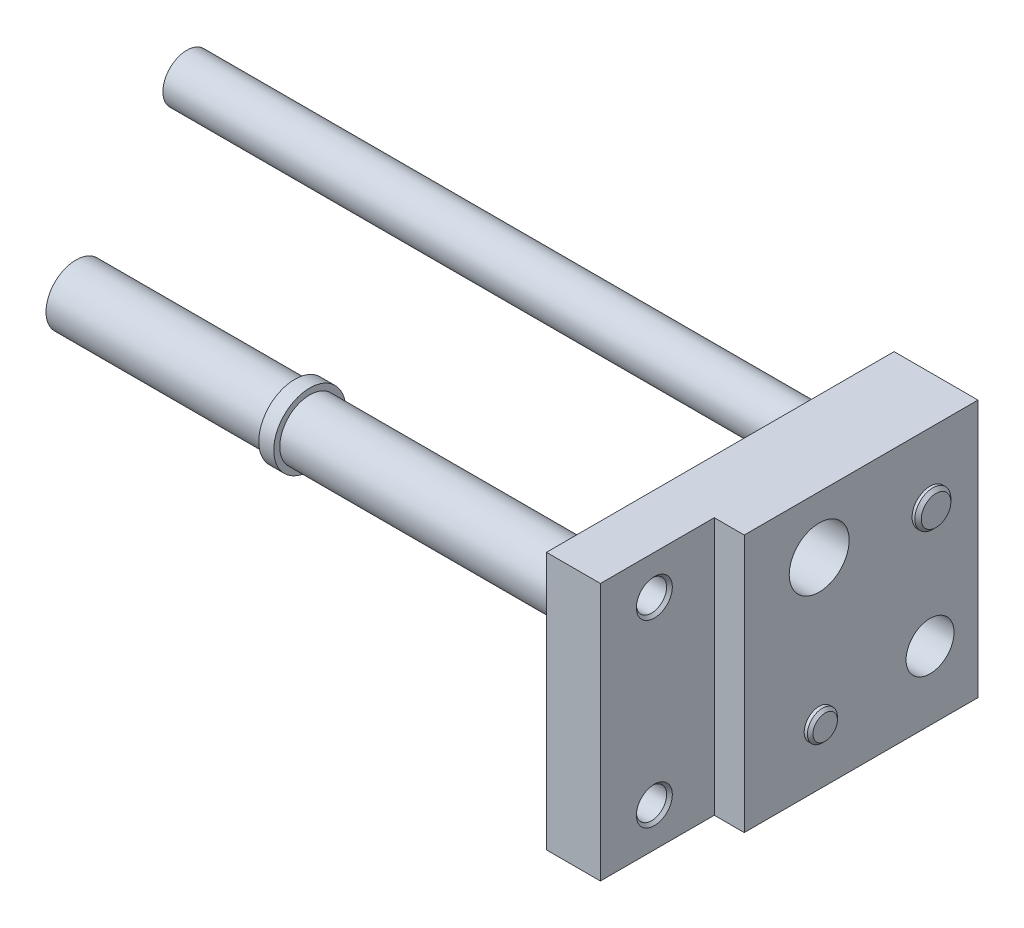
ISO-10303-21;
HEADER;
FILE_DESCRIPTION(('STEP AP214'),'2;1');
FILE_NAME('part.step','',(''),(''),'','','');
FILE_SCHEMA(('AUTOMOTIVE_DESIGN { 1 0 10303 214 1 1 1 1 }'));
ENDSEC;
DATA;
#1=APPLICATION_CONTEXT('core data for automotive mechanical design processes');
#2=APPLICATION_PROTOCOL_DEFINITION('international standard','automotive_design',2000,#1);
#3=PRODUCT_CONTEXT('',#1,'mechanical');
#4=PRODUCT('Part','Part','',(#3));
#5=PRODUCT_RELATED_PRODUCT_CATEGORY('part','',(#4));
#6=PRODUCT_DEFINITION_FORMATION('','',#4);
#7=PRODUCT_DEFINITION_CONTEXT('part definition',#1,'design');
#8=PRODUCT_DEFINITION('design','',#6,#7);
#9=PRODUCT_DEFINITION_SHAPE('','',#8);
#10=(LENGTH_UNIT() NAMED_UNIT(*) SI_UNIT(.MILLI.,.METRE.));
#11=(NAMED_UNIT(*) PLANE_ANGLE_UNIT() SI_UNIT($,.RADIAN.));
#12=(NAMED_UNIT(*) SI_UNIT($,.STERADIAN.) SOLID_ANGLE_UNIT());
#13=UNCERTAINTY_MEASURE_WITH_UNIT(LENGTH_MEASURE(1.E-05),#10,'distance_accuracy_value','');
#14=(GEOMETRIC_REPRESENTATION_CONTEXT(3) GLOBAL_UNCERTAINTY_ASSIGNED_CONTEXT((#13)) GLOBAL_UNIT_ASSIGNED_CONTEXT((#10,
#11,#12)) REPRESENTATION_CONTEXT('',''));
#15=CARTESIAN_POINT('',(0.,0.,0.));
#16=DIRECTION('',(0.,0.,1.));
#17=DIRECTION('',(1.,0.,0.));
#18=AXIS2_PLACEMENT_3D('',#15,#16,#17);
#19=CARTESIAN_POINT('',(0.,-43.,-38.5));
#20=DIRECTION('',(0.,0.,-1.));
#21=DIRECTION('',(0.,1.,0.));
#22=AXIS2_PLACEMENT_3D('',#19,#20,#21);
#23=PLANE('',#22);
#24=DIRECTION('',(-1.,0.,0.));
#25=VECTOR('',#24,1.);
#26=CARTESIAN_POINT('',(28.,-43.,-38.5));
#27=LINE('',#26,#25);
#28=CARTESIAN_POINT('',(28.,-43.,-38.5));
#29=VERTEX_POINT('',#28);
#30=CARTESIAN_POINT('',(0.,-43.,-38.5));
#31=VERTEX_POINT('',#30);
#32=EDGE_CURVE('E71',#29,#31,#27,.T.);
#33=ORIENTED_EDGE('',*,*,#32,.T.);
#34=DIRECTION('',(0.,1.,0.));
#35=VECTOR('',#34,1.);
#36=CARTESIAN_POINT('',(0.,-43.,-38.5));
#37=LINE('',#36,#35);
#38=CARTESIAN_POINT('',(0.,43.,-38.5));
#39=VERTEX_POINT('',#38);
#40=EDGE_CURVE('E85',#39,#31,#37,.F.);
#41=ORIENTED_EDGE('',*,*,#40,.F.);
#42=DIRECTION('',(1.,0.,0.));
#43=VECTOR('',#42,1.);
#44=CARTESIAN_POINT('',(0.,43.,-38.5));
#45=LINE('',#44,#43);
#46=CARTESIAN_POINT('',(28.,43.,-38.5));
#47=VERTEX_POINT('',#46);
#48=EDGE_CURVE('E92',#47,#39,#45,.F.);
#49=ORIENTED_EDGE('',*,*,#48,.F.);
#50=DIRECTION('',(0.,-1.,0.));
#51=VECTOR('',#50,1.);
#52=CARTESIAN_POINT('',(28.,43.,-38.5));
#53=LINE('',#52,#51);
#54=EDGE_CURVE('E79',#47,#29,#53,.T.);
#55=ORIENTED_EDGE('',*,*,#54,.T.);
#56=EDGE_LOOP('',(#33,#41,#49,#55));
#57=FACE_BOUND('',#56,.T.);
#58=ADVANCED_FACE('F17',(#57),#23,.T.);
#59=CARTESIAN_POINT('',(0.,-43.,77.5));
#60=DIRECTION('',(-1.,0.,0.));
#61=DIRECTION('',(0.,1.,0.));
#62=AXIS2_PLACEMENT_3D('',#59,#60,#61);
#63=PLANE('',#62);
#64=DIRECTION('',(0.,0.,1.));
#65=VECTOR('',#64,1.);
#66=CARTESIAN_POINT('',(0.,-43.,-38.5));
#67=LINE('',#66,#65);
#68=CARTESIAN_POINT('',(0.,-43.,77.5));
#69=VERTEX_POINT('',#68);
#70=EDGE_CURVE('E68',#31,#69,#67,.T.);
#71=ORIENTED_EDGE('',*,*,#70,.T.);
#72=DIRECTION('',(0.,1.,0.));
#73=VECTOR('',#72,1.);
#74=CARTESIAN_POINT('',(0.,-43.,77.5));
#75=LINE('',#74,#73);
#76=CARTESIAN_POINT('',(0.,43.,77.5));
#77=VERTEX_POINT('',#76);
#78=EDGE_CURVE('E78',#77,#69,#75,.F.);
#79=ORIENTED_EDGE('',*,*,#78,.F.);
#80=DIRECTION('',(0.,0.,-1.));
#81=VECTOR('',#80,1.);
#82=CARTESIAN_POINT('',(0.,43.,77.5));
#83=LINE('',#82,#81);
#84=EDGE_CURVE('E91',#39,#77,#83,.F.);
#85=ORIENTED_EDGE('',*,*,#84,.F.);
#86=ORIENTED_EDGE('',*,*,#40,.T.);
#87=EDGE_LOOP('',(#71,#79,#85,#86));
#88=FACE_BOUND('',#87,.T.);
#89=CARTESIAN_POINT('',(0.,24.,14.5));
#90=DIRECTION('',(1.,0.,0.));
#91=DIRECTION('',(0.,-1.16828431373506E-09,1.));
#92=AXIS2_PLACEMENT_3D('',#89,#90,#91);
#93=CIRCLE('',#92,10.);
#94=CARTESIAN_POINT('',(0.,23.9999999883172,24.5));
#95=VERTEX_POINT('',#94);
#96=EDGE_CURVE('E111',#95,#95,#93,.T.);
#97=ORIENTED_EDGE('',*,*,#96,.T.);
#98=EDGE_LOOP('',(#97));
#99=FACE_BOUND('',#98,.T.);
#100=CARTESIAN_POINT('',(0.,-24.,14.5));
#101=DIRECTION('',(1.,0.,0.));
#102=DIRECTION('',(0.,-1.16828573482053E-09,1.));
#103=AXIS2_PLACEMENT_3D('',#100,#101,#102);
#104=CIRCLE('',#103,10.);
#105=CARTESIAN_POINT('',(0.,-24.0000000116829,24.5));
#106=VERTEX_POINT('',#105);
#107=EDGE_CURVE('E116',#106,#106,#104,.F.);
#108=ORIENTED_EDGE('',*,*,#107,.F.);
#109=EDGE_LOOP('',(#108));
#110=FACE_BOUND('',#109,.T.);
#111=CARTESIAN_POINT('',(0.,-20.1,-22.5));
#112=DIRECTION('',(1.,0.,0.));
#113=DIRECTION('',(0.,-1.16853904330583E-09,1.));
#114=AXIS2_PLACEMENT_3D('',#111,#112,#113);
#115=CIRCLE('',#114,8.);
#116=CARTESIAN_POINT('',(0.,-20.1000000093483,-14.5));
#117=VERTEX_POINT('',#116);
#118=EDGE_CURVE('E119',#117,#117,#115,.T.);
#119=ORIENTED_EDGE('',*,*,#118,.T.);
#120=EDGE_LOOP('',(#119));
#121=FACE_BOUND('',#120,.T.);
#122=CARTESIAN_POINT('',(0.,20.1,-22.5));
#123=DIRECTION('',(1.,0.,0.));
#124=DIRECTION('',(0.,-1.16817577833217E-09,1.));
#125=AXIS2_PLACEMENT_3D('',#122,#123,#124);
#126=CIRCLE('',#125,8.);
#127=CARTESIAN_POINT('',(0.,20.0999999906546,-14.5));
#128=VERTEX_POINT('',#127);
#129=EDGE_CURVE('E122',#128,#128,#126,.F.);
#130=ORIENTED_EDGE('',*,*,#129,.F.);
#131=EDGE_LOOP('',(#130));
#132=FACE_BOUND('',#131,.T.);
#133=CARTESIAN_POINT('',(0.,30.,59.5));
#134=DIRECTION('',(1.,0.,0.));
#135=DIRECTION('',(0.,0.,1.));
#136=AXIS2_PLACEMENT_3D('',#133,#134,#135);
#137=CIRCLE('',#136,6.);
#138=CARTESIAN_POINT('',(0.,30.,65.5));
#139=VERTEX_POINT('',#138);
#140=EDGE_CURVE('E125',#139,#139,#137,.T.);
#141=ORIENTED_EDGE('',*,*,#140,.T.);
#142=EDGE_LOOP('',(#141));
#143=FACE_BOUND('',#142,.T.);
#144=CARTESIAN_POINT('',(0.,-30.,59.5));
#145=DIRECTION('',(1.,0.,0.));
#146=DIRECTION('',(0.,0.,1.));
#147=AXIS2_PLACEMENT_3D('',#144,#145,#146);
#148=CIRCLE('',#147,6.);
#149=CARTESIAN_POINT('',(0.,-30.,65.5));
#150=VERTEX_POINT('',#149);
#151=EDGE_CURVE('E128',#150,#150,#148,.T.);
#152=ORIENTED_EDGE('',*,*,#151,.T.);
#153=EDGE_LOOP('',(#152));
#154=FACE_BOUND('',#153,.T.);
#155=ADVANCED_FACE('F89',(#88,#99,#110,#121,#132,#143,#154),#63,.T.);
#156=CARTESIAN_POINT('',(18.,-43.,77.5));
#157=DIRECTION('',(0.,0.,1.));
#158=DIRECTION('',(0.,1.,0.));
#159=AXIS2_PLACEMENT_3D('',#156,#157,#158);
#160=PLANE('',#159);
#161=DIRECTION('',(1.,0.,0.));
#162=VECTOR('',#161,1.);
#163=CARTESIAN_POINT('',(0.,-43.,77.5));
#164=LINE('',#163,#162);
#165=CARTESIAN_POINT('',(18.,-43.,77.5));
#166=VERTEX_POINT('',#165);
#167=EDGE_CURVE('E73',#69,#166,#164,.T.);
#168=ORIENTED_EDGE('',*,*,#167,.T.);
#169=DIRECTION('',(0.,1.,0.));
#170=VECTOR('',#169,1.);
#171=CARTESIAN_POINT('',(18.,-43.,77.5));
#172=LINE('',#171,#170);
#173=CARTESIAN_POINT('',(18.,43.,77.5));
#174=VERTEX_POINT('',#173);
#175=EDGE_CURVE('E132',#174,#166,#172,.F.);
#176=ORIENTED_EDGE('',*,*,#175,.F.);
#177=DIRECTION('',(-1.,0.,0.));
#178=VECTOR('',#177,1.);
#179=CARTESIAN_POINT('',(18.,43.,77.5));
#180=LINE('',#179,#178);
#181=EDGE_CURVE('E137',#77,#174,#180,.F.);
#182=ORIENTED_EDGE('',*,*,#181,.F.);
#183=ORIENTED_EDGE('',*,*,#78,.T.);
#184=EDGE_LOOP('',(#168,#176,#182,#183));
#185=FACE_BOUND('',#184,.T.);
#186=ADVANCED_FACE('F251',(#185),#160,.T.);
#187=CARTESIAN_POINT('',(18.,-43.,39.5));
#188=DIRECTION('',(1.,0.,0.));
#189=DIRECTION('',(0.,1.,0.));
#190=AXIS2_PLACEMENT_3D('',#187,#188,#189);
#191=PLANE('',#190);
#192=DIRECTION('',(0.,0.,-1.));
#193=VECTOR('',#192,1.);
#194=CARTESIAN_POINT('',(18.,-43.,77.5));
#195=LINE('',#194,#193);
#196=CARTESIAN_POINT('',(18.,-43.,39.5));
#197=VERTEX_POINT('',#196);
#198=EDGE_CURVE('E141',#166,#197,#195,.T.);
#199=ORIENTED_EDGE('',*,*,#198,.T.);
#200=DIRECTION('',(0.,1.,0.));
#201=VECTOR('',#200,1.);
#202=CARTESIAN_POINT('',(18.,-43.,39.5));
#203=LINE('',#202,#201);
#204=CARTESIAN_POINT('',(18.,43.,39.5));
#205=VERTEX_POINT('',#204);
#206=EDGE_CURVE('E146',#205,#197,#203,.F.);
#207=ORIENTED_EDGE('',*,*,#206,.F.);
#208=DIRECTION('',(0.,0.,1.));
#209=VECTOR('',#208,1.);
#210=CARTESIAN_POINT('',(18.,43.,39.5));
#211=LINE('',#210,#209);
#212=EDGE_CURVE('E151',#174,#205,#211,.F.);
#213=ORIENTED_EDGE('',*,*,#212,.F.);
#214=ORIENTED_EDGE('',*,*,#175,.T.);
#215=EDGE_LOOP('',(#199,#207,#213,#214));
#216=FACE_BOUND('',#215,.T.);
#217=CARTESIAN_POINT('',(18.,30.,59.5));
#218=DIRECTION('',(-1.,0.,0.));
#219=DIRECTION('',(0.,0.,-1.));
#220=AXIS2_PLACEMENT_3D('',#217,#218,#219);
#221=CIRCLE('',#220,6.00000000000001);
#222=CARTESIAN_POINT('',(18.,30.,53.5));
#223=VERTEX_POINT('',#222);
#224=EDGE_CURVE('E155',#223,#223,#221,.F.);
#225=ORIENTED_EDGE('',*,*,#224,.F.);
#226=EDGE_LOOP('',(#225));
#227=FACE_BOUND('',#226,.T.);
#228=CARTESIAN_POINT('',(18.,-30.,59.5));
#229=DIRECTION('',(-1.,0.,0.));
#230=DIRECTION('',(0.,0.,-1.));
#231=AXIS2_PLACEMENT_3D('',#228,#229,#230);
#232=CIRCLE('',#231,6.00000000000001);
#233=CARTESIAN_POINT('',(18.,-30.,53.5));
#234=VERTEX_POINT('',#233);
#235=EDGE_CURVE('E160',#234,#234,#232,.F.);
#236=ORIENTED_EDGE('',*,*,#235,.F.);
#237=EDGE_LOOP('',(#236));
#238=FACE_BOUND('',#237,.T.);
#239=ADVANCED_FACE('F256',(#216,#227,#238),#191,.T.);
#240=CARTESIAN_POINT('',(28.,-43.,39.5));
#241=DIRECTION('',(0.,0.,1.));
#242=DIRECTION('',(0.,1.,0.));
#243=AXIS2_PLACEMENT_3D('',#240,#241,#242);
#244=PLANE('',#243);
#245=DIRECTION('',(1.,0.,0.));
#246=VECTOR('',#245,1.);
#247=CARTESIAN_POINT('',(18.,-43.,39.5));
#248=LINE('',#247,#246);
#249=CARTESIAN_POINT('',(28.,-43.,39.5));
#250=VERTEX_POINT('',#249);
#251=EDGE_CURVE('E163',#197,#250,#248,.T.);
#252=ORIENTED_EDGE('',*,*,#251,.T.);
#253=DIRECTION('',(0.,1.,0.));
#254=VECTOR('',#253,1.);
#255=CARTESIAN_POINT('',(28.,-43.,39.5));
#256=LINE('',#255,#254);
#257=CARTESIAN_POINT('',(28.,43.,39.5));
#258=VERTEX_POINT('',#257);
#259=EDGE_CURVE('E165',#258,#250,#256,.F.);
#260=ORIENTED_EDGE('',*,*,#259,.F.);
#261=DIRECTION('',(-1.,0.,0.));
#262=VECTOR('',#261,1.);
#263=CARTESIAN_POINT('',(28.,43.,39.5));
#264=LINE('',#263,#262);
#265=EDGE_CURVE('E32',#205,#258,#264,.F.);
#266=ORIENTED_EDGE('',*,*,#265,.F.);
#267=ORIENTED_EDGE('',*,*,#206,.T.);
#268=EDGE_LOOP('',(#252,#260,#266,#267));
#269=FACE_BOUND('',#268,.T.);
#270=ADVANCED_FACE('F260',(#269),#244,.T.);
#271=CARTESIAN_POINT('',(28.,-43.,-38.5));
#272=DIRECTION('',(1.,0.,0.));
#273=DIRECTION('',(0.,1.,0.));
#274=AXIS2_PLACEMENT_3D('',#271,#272,#273);
#275=PLANE('',#274);
#276=DIRECTION('',(0.,0.,-1.));
#277=VECTOR('',#276,1.);
#278=CARTESIAN_POINT('',(28.,-43.,39.5));
#279=LINE('',#278,#277);
#280=EDGE_CURVE('E40',#250,#29,#279,.T.);
#281=ORIENTED_EDGE('',*,*,#280,.T.);
#282=ORIENTED_EDGE('',*,*,#54,.F.);
#283=DIRECTION('',(0.,0.,1.));
#284=VECTOR('',#283,1.);
#285=CARTESIAN_POINT('',(28.,43.,-38.5));
#286=LINE('',#285,#284);
#287=EDGE_CURVE('E176',#258,#47,#286,.F.);
#288=ORIENTED_EDGE('',*,*,#287,.F.);
#289=ORIENTED_EDGE('',*,*,#259,.T.);
#290=EDGE_LOOP('',(#281,#282,#288,#289));
#291=FACE_BOUND('',#290,.T.);
#292=CARTESIAN_POINT('',(28.,24.,14.5));
#293=DIRECTION('',(-1.,0.,0.));
#294=DIRECTION('',(0.,0.,-1.));
#295=AXIS2_PLACEMENT_3D('',#292,#293,#294);
#296=CIRCLE('',#295,10.);
#297=CARTESIAN_POINT('',(28.,24.,4.5));
#298=VERTEX_POINT('',#297);
#299=EDGE_CURVE('E180',#298,#298,#296,.F.);
#300=ORIENTED_EDGE('',*,*,#299,.F.);
#301=EDGE_LOOP('',(#300));
#302=FACE_BOUND('',#301,.T.);
#303=CARTESIAN_POINT('',(28.,-20.1,-22.5));
#304=DIRECTION('',(-1.,0.,0.));
#305=DIRECTION('',(0.,0.,-1.));
#306=AXIS2_PLACEMENT_3D('',#303,#304,#305);
#307=CIRCLE('',#306,8.);
#308=CARTESIAN_POINT('',(28.,-20.1,-30.5));
#309=VERTEX_POINT('',#308);
#310=EDGE_CURVE('E185',#309,#309,#307,.F.);
#311=ORIENTED_EDGE('',*,*,#310,.F.);
#312=EDGE_LOOP('',(#311));
#313=FACE_BOUND('',#312,.T.);
#314=CARTESIAN_POINT('',(28.,20.1,-22.5));
#315=DIRECTION('',(-1.,0.,0.));
#316=DIRECTION('',(0.,0.,-1.));
#317=AXIS2_PLACEMENT_3D('',#314,#315,#316);
#318=CIRCLE('',#317,6.);
#319=CARTESIAN_POINT('',(28.,20.1,-28.5));
#320=VERTEX_POINT('',#319);
#321=EDGE_CURVE('E188',#320,#320,#318,.F.);
#322=ORIENTED_EDGE('',*,*,#321,.F.);
#323=EDGE_LOOP('',(#322));
#324=FACE_BOUND('',#323,.T.);
#325=CARTESIAN_POINT('',(28.,-24.,14.5));
#326=DIRECTION('',(-1.,0.,0.));
#327=DIRECTION('',(0.,-1.42053902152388E-07,-0.99999999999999));
#328=AXIS2_PLACEMENT_3D('',#325,#326,#327);
#329=CIRCLE('',#328,5.);
#330=CARTESIAN_POINT('',(28.,-24.0000007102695,9.50000000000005));
#331=VERTEX_POINT('',#330);
#332=EDGE_CURVE('E191',#331,#331,#329,.F.);
#333=ORIENTED_EDGE('',*,*,#332,.F.);
#334=EDGE_LOOP('',(#333));
#335=FACE_BOUND('',#334,.T.);
#336=ADVANCED_FACE('F264',(#291,#302,#313,#324,#335),#275,.T.);
#337=CARTESIAN_POINT('',(0.,43.,-38.5));
#338=DIRECTION('',(0.,1.,0.));
#339=DIRECTION('',(0.,0.,1.));
#340=AXIS2_PLACEMENT_3D('',#337,#338,#339);
#341=PLANE('',#340);
#342=ORIENTED_EDGE('',*,*,#48,.T.);
#343=ORIENTED_EDGE('',*,*,#84,.T.);
#344=ORIENTED_EDGE('',*,*,#181,.T.);
#345=ORIENTED_EDGE('',*,*,#212,.T.);
#346=ORIENTED_EDGE('',*,*,#265,.T.);
#347=ORIENTED_EDGE('',*,*,#287,.T.);
#348=EDGE_LOOP('',(#342,#343,#344,#345,#346,#347));
#349=FACE_BOUND('',#348,.T.);
#350=ADVANCED_FACE('F268',(#349),#341,.T.);
#351=CARTESIAN_POINT('',(0.,-43.,-38.5));
#352=DIRECTION('',(0.,-1.,0.));
#353=DIRECTION('',(1.,0.,0.));
#354=AXIS2_PLACEMENT_3D('',#351,#352,#353);
#355=PLANE('',#354);
#356=ORIENTED_EDGE('',*,*,#32,.F.);
#357=ORIENTED_EDGE('',*,*,#280,.F.);
#358=ORIENTED_EDGE('',*,*,#251,.F.);
#359=ORIENTED_EDGE('',*,*,#198,.F.);
#360=ORIENTED_EDGE('',*,*,#167,.F.);
#361=ORIENTED_EDGE('',*,*,#70,.F.);
#362=EDGE_LOOP('',(#356,#357,#358,#359,#360,#361));
#363=FACE_BOUND('',#362,.T.);
#364=ADVANCED_FACE('F70',(#363),#355,.T.);
#365=CARTESIAN_POINT('',(30.,15.1735002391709,-27.4265));
#366=DIRECTION('',(1.,0.,0.));
#367=DIRECTION('',(0.,1.,0.));
#368=AXIS2_PLACEMENT_3D('',#365,#366,#367);
#369=PLANE('',#368);
#370=CARTESIAN_POINT('',(30.,20.1,-22.5));
#371=DIRECTION('',(1.,0.,0.));
#372=DIRECTION('',(0.,-1.42331208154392E-07,0.99999999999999));
#373=AXIS2_PLACEMENT_3D('',#370,#371,#372);
#374=CIRCLE('',#373,4.9265);
#375=CARTESIAN_POINT('',(30.,20.0999992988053,-17.5735));
#376=VERTEX_POINT('',#375);
#377=EDGE_CURVE('E194',#376,#376,#374,.T.);
#378=ORIENTED_EDGE('',*,*,#377,.T.);
#379=EDGE_LOOP('',(#378));
#380=FACE_BOUND('',#379,.T.);
#381=ADVANCED_FACE('F274',(#380),#369,.T.);
#382=CARTESIAN_POINT('',(-220.,11.8814083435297,-14.5));
#383=DIRECTION('',(-1.,0.,0.));
#384=DIRECTION('',(0.,1.,0.));
#385=AXIS2_PLACEMENT_3D('',#382,#383,#384);
#386=PLANE('',#385);
#387=CARTESIAN_POINT('',(-220.,20.1,-22.5));
#388=DIRECTION('',(-1.,0.,0.));
#389=DIRECTION('',(0.,0.,-1.));
#390=AXIS2_PLACEMENT_3D('',#387,#388,#389);
#391=CIRCLE('',#390,8.);
#392=CARTESIAN_POINT('',(-220.,20.1,-30.5));
#393=VERTEX_POINT('',#392);
#394=EDGE_CURVE('E197',#393,#393,#391,.F.);
#395=ORIENTED_EDGE('',*,*,#394,.F.);
#396=EDGE_LOOP('',(#395));
#397=FACE_BOUND('',#396,.T.);
#398=ADVANCED_FACE('F277',(#397),#386,.T.);
#399=CARTESIAN_POINT('',(30.,-28.0799998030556,10.42));
#400=DIRECTION('',(1.,0.,0.));
#401=DIRECTION('',(0.,1.,0.));
#402=AXIS2_PLACEMENT_3D('',#399,#400,#401);
#403=PLANE('',#402);
#404=CARTESIAN_POINT('',(30.,-24.,14.5));
#405=DIRECTION('',(1.,0.,0.));
#406=DIRECTION('',(0.,-1.41518687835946E-07,0.99999999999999));
#407=AXIS2_PLACEMENT_3D('',#404,#405,#406);
#408=CIRCLE('',#407,4.07999999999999);
#409=CARTESIAN_POINT('',(30.,-24.0000005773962,18.58));
#410=VERTEX_POINT('',#409);
#411=EDGE_CURVE('E200',#410,#410,#408,.T.);
#412=ORIENTED_EDGE('',*,*,#411,.T.);
#413=EDGE_LOOP('',(#412));
#414=FACE_BOUND('',#413,.T.);
#415=ADVANCED_FACE('F281',(#414),#403,.T.);
#416=CARTESIAN_POINT('',(-220.,-34.2732395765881,24.5));
#417=DIRECTION('',(-1.,0.,0.));
#418=DIRECTION('',(0.,1.,0.));
#419=AXIS2_PLACEMENT_3D('',#416,#417,#418);
#420=PLANE('',#419);
#421=CARTESIAN_POINT('',(-220.,-24.,14.5));
#422=DIRECTION('',(-1.,0.,0.));
#423=DIRECTION('',(0.,0.,-1.));
#424=AXIS2_PLACEMENT_3D('',#421,#422,#423);
#425=CIRCLE('',#424,10.);
#426=CARTESIAN_POINT('',(-220.,-24.,4.5));
#427=VERTEX_POINT('',#426);
#428=EDGE_CURVE('E203',#427,#427,#425,.F.);
#429=ORIENTED_EDGE('',*,*,#428,.F.);
#430=EDGE_LOOP('',(#429));
#431=FACE_BOUND('',#430,.T.);
#432=ADVANCED_FACE('F285',(#431),#420,.T.);
#433=CARTESIAN_POINT('',(-147.,-36.3278874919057,26.5));
#434=DIRECTION('',(-1.,0.,0.));
#435=DIRECTION('',(0.,1.,0.));
#436=AXIS2_PLACEMENT_3D('',#433,#434,#435);
#437=PLANE('',#436);
#438=CARTESIAN_POINT('',(-147.,-24.,14.5));
#439=DIRECTION('',(-1.,0.,0.));
#440=DIRECTION('',(0.,0.,-1.));
#441=AXIS2_PLACEMENT_3D('',#438,#439,#440);
#442=CIRCLE('',#441,12.);
#443=CARTESIAN_POINT('',(-147.,-24.,2.5));
#444=VERTEX_POINT('',#443);
#445=EDGE_CURVE('E206',#444,#444,#442,.F.);
#446=ORIENTED_EDGE('',*,*,#445,.F.);
#447=EDGE_LOOP('',(#446));
#448=FACE_BOUND('',#447,.T.);
#449=CARTESIAN_POINT('',(-147.,-24.,14.5));
#450=DIRECTION('',(1.,0.,0.));
#451=DIRECTION('',(0.,0.,1.));
#452=AXIS2_PLACEMENT_3D('',#449,#450,#451);
#453=CIRCLE('',#452,10.);
#454=CARTESIAN_POINT('',(-147.,-24.,24.5));
#455=VERTEX_POINT('',#454);
#456=EDGE_CURVE('E209',#455,#455,#453,.T.);
#457=ORIENTED_EDGE('',*,*,#456,.T.);
#458=EDGE_LOOP('',(#457));
#459=FACE_BOUND('',#458,.T.);
#460=ADVANCED_FACE('F289',(#448,#459),#437,.T.);
#461=CARTESIAN_POINT('',(-142.,-36.3278874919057,2.5));
#462=DIRECTION('',(1.,0.,0.));
#463=DIRECTION('',(0.,1.,0.));
#464=AXIS2_PLACEMENT_3D('',#461,#462,#463);
#465=PLANE('',#464);
#466=CARTESIAN_POINT('',(-142.,-24.,14.5));
#467=DIRECTION('',(1.,0.,0.));
#468=DIRECTION('',(0.,0.,1.));
#469=AXIS2_PLACEMENT_3D('',#466,#467,#468);
#470=CIRCLE('',#469,12.);
#471=CARTESIAN_POINT('',(-142.,-24.,26.5));
#472=VERTEX_POINT('',#471);
#473=EDGE_CURVE('E212',#472,#472,#470,.T.);
#474=ORIENTED_EDGE('',*,*,#473,.T.);
#475=EDGE_LOOP('',(#474));
#476=FACE_BOUND('',#475,.T.);
#477=CARTESIAN_POINT('',(-142.,-24.,14.5));
#478=DIRECTION('',(-1.,0.,0.));
#479=DIRECTION('',(0.,0.,-1.));
#480=AXIS2_PLACEMENT_3D('',#477,#478,#479);
#481=CIRCLE('',#480,10.);
#482=CARTESIAN_POINT('',(-142.,-24.,4.5));
#483=VERTEX_POINT('',#482);
#484=EDGE_CURVE('E215',#483,#483,#481,.F.);
#485=ORIENTED_EDGE('',*,*,#484,.F.);
#486=EDGE_LOOP('',(#485));
#487=FACE_BOUND('',#486,.T.);
#488=ADVANCED_FACE('F293',(#476,#487),#465,.T.);
#489=CARTESIAN_POINT('',(28.,-20.1,-22.5));
#490=DIRECTION('',(1.,0.,0.));
#491=DIRECTION('',(0.,1.16853916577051E-09,1.));
#492=AXIS2_PLACEMENT_3D('',#489,#490,#491);
#493=CYLINDRICAL_SURFACE('',#492,8.);
#494=ORIENTED_EDGE('',*,*,#310,.T.);
#495=EDGE_LOOP('',(#494));
#496=FACE_BOUND('',#495,.T.);
#497=ORIENTED_EDGE('',*,*,#118,.F.);
#498=EDGE_LOOP('',(#497));
#499=FACE_BOUND('',#498,.T.);
#500=ADVANCED_FACE('F297',(#496,#499),#493,.F.);
#501=CARTESIAN_POINT('',(28.9265,20.1,-22.5));
#502=DIRECTION('',(-1.,0.,0.));
#503=DIRECTION('',(0.,0.,-1.));
#504=AXIS2_PLACEMENT_3D('',#501,#502,#503);
#505=CONICAL_SURFACE('',#504,6.,0.785398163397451);
#506=ORIENTED_EDGE('',*,*,#377,.F.);
#507=EDGE_LOOP('',(#506));
#508=FACE_BOUND('',#507,.T.);
#509=CARTESIAN_POINT('',(28.9265,20.1,-22.5));
#510=DIRECTION('',(1.,0.,0.));
#511=DIRECTION('',(0.,0.,1.));
#512=AXIS2_PLACEMENT_3D('',#509,#510,#511);
#513=CIRCLE('',#512,6.);
#514=CARTESIAN_POINT('',(28.9265,20.1,-16.5));
#515=VERTEX_POINT('',#514);
#516=EDGE_CURVE('E218',#515,#515,#513,.T.);
#517=ORIENTED_EDGE('',*,*,#516,.T.);
#518=EDGE_LOOP('',(#517));
#519=FACE_BOUND('',#518,.T.);
#520=ADVANCED_FACE('F301',(#508,#519),#505,.T.);
#521=CARTESIAN_POINT('',(30.,20.1,-22.5));
#522=DIRECTION('',(1.,0.,0.));
#523=DIRECTION('',(0.,0.,1.));
#524=AXIS2_PLACEMENT_3D('',#521,#522,#523);
#525=CYLINDRICAL_SURFACE('',#524,6.);
#526=ORIENTED_EDGE('',*,*,#321,.T.);
#527=EDGE_LOOP('',(#526));
#528=FACE_BOUND('',#527,.T.);
#529=ORIENTED_EDGE('',*,*,#516,.F.);
#530=EDGE_LOOP('',(#529));
#531=FACE_BOUND('',#530,.T.);
#532=ADVANCED_FACE('F305',(#528,#531),#525,.T.);
#533=CARTESIAN_POINT('',(30.,20.1,-22.5));
#534=DIRECTION('',(1.,0.,0.));
#535=DIRECTION('',(0.,1.16853916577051E-09,1.));
#536=AXIS2_PLACEMENT_3D('',#533,#534,#535);
#537=CYLINDRICAL_SURFACE('',#536,8.);
#538=ORIENTED_EDGE('',*,*,#129,.T.);
#539=EDGE_LOOP('',(#538));
#540=FACE_BOUND('',#539,.T.);
#541=ORIENTED_EDGE('',*,*,#394,.T.);
#542=EDGE_LOOP('',(#541));
#543=FACE_BOUND('',#542,.T.);
#544=ADVANCED_FACE('F309',(#540,#543),#537,.T.);
#545=CARTESIAN_POINT('',(28.,24.,14.5));
#546=DIRECTION('',(1.,0.,0.));
#547=DIRECTION('',(0.,0.,1.));
#548=AXIS2_PLACEMENT_3D('',#545,#546,#547);
#549=CYLINDRICAL_SURFACE('',#548,10.);
#550=ORIENTED_EDGE('',*,*,#299,.T.);
#551=EDGE_LOOP('',(#550));
#552=FACE_BOUND('',#551,.T.);
#553=ORIENTED_EDGE('',*,*,#96,.F.);
#554=EDGE_LOOP('',(#553));
#555=FACE_BOUND('',#554,.T.);
#556=ADVANCED_FACE('F313',(#552,#555),#549,.F.);
#557=CARTESIAN_POINT('',(29.08,-24.,14.5));
#558=DIRECTION('',(-1.,0.,0.));
#559=DIRECTION('',(0.,0.,-1.));
#560=AXIS2_PLACEMENT_3D('',#557,#558,#559);
#561=CONICAL_SURFACE('',#560,5.,0.785398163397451);
#562=ORIENTED_EDGE('',*,*,#411,.F.);
#563=EDGE_LOOP('',(#562));
#564=FACE_BOUND('',#563,.T.);
#565=CARTESIAN_POINT('',(29.08,-24.,14.5));
#566=DIRECTION('',(1.,0.,0.));
#567=DIRECTION('',(0.,0.,1.));
#568=AXIS2_PLACEMENT_3D('',#565,#566,#567);
#569=CIRCLE('',#568,5.);
#570=CARTESIAN_POINT('',(29.08,-24.,19.5));
#571=VERTEX_POINT('',#570);
#572=EDGE_CURVE('E221',#571,#571,#569,.T.);
#573=ORIENTED_EDGE('',*,*,#572,.T.);
#574=EDGE_LOOP('',(#573));
#575=FACE_BOUND('',#574,.T.);
#576=ADVANCED_FACE('F317',(#564,#575),#561,.T.);
#577=CARTESIAN_POINT('',(30.,-24.,14.5));
#578=DIRECTION('',(1.,0.,0.));
#579=DIRECTION('',(0.,0.,1.));
#580=AXIS2_PLACEMENT_3D('',#577,#578,#579);
#581=CYLINDRICAL_SURFACE('',#580,5.);
#582=ORIENTED_EDGE('',*,*,#332,.T.);
#583=EDGE_LOOP('',(#582));
#584=FACE_BOUND('',#583,.T.);
#585=ORIENTED_EDGE('',*,*,#572,.F.);
#586=EDGE_LOOP('',(#585));
#587=FACE_BOUND('',#586,.T.);
#588=ADVANCED_FACE('F321',(#584,#587),#581,.T.);
#589=CARTESIAN_POINT('',(30.,-24.,14.5));
#590=DIRECTION('',(1.,0.,0.));
#591=DIRECTION('',(0.,0.,1.));
#592=AXIS2_PLACEMENT_3D('',#589,#590,#591);
#593=CYLINDRICAL_SURFACE('',#592,10.);
#594=ORIENTED_EDGE('',*,*,#107,.T.);
#595=EDGE_LOOP('',(#594));
#596=FACE_BOUND('',#595,.T.);
#597=ORIENTED_EDGE('',*,*,#484,.T.);
#598=EDGE_LOOP('',(#597));
#599=FACE_BOUND('',#598,.T.);
#600=ADVANCED_FACE('F325',(#596,#599),#593,.T.);
#601=CARTESIAN_POINT('',(30.,-24.,14.5));
#602=DIRECTION('',(1.,0.,0.));
#603=DIRECTION('',(0.,0.,1.));
#604=AXIS2_PLACEMENT_3D('',#601,#602,#603);
#605=CYLINDRICAL_SURFACE('',#604,10.);
#606=ORIENTED_EDGE('',*,*,#456,.F.);
#607=EDGE_LOOP('',(#606));
#608=FACE_BOUND('',#607,.T.);
#609=ORIENTED_EDGE('',*,*,#428,.T.);
#610=EDGE_LOOP('',(#609));
#611=FACE_BOUND('',#610,.T.);
#612=ADVANCED_FACE('F329',(#608,#611),#605,.T.);
#613=CARTESIAN_POINT('',(30.,-24.,14.5));
#614=DIRECTION('',(1.,0.,0.));
#615=DIRECTION('',(0.,0.,1.));
#616=AXIS2_PLACEMENT_3D('',#613,#614,#615);
#617=CYLINDRICAL_SURFACE('',#616,12.);
#618=ORIENTED_EDGE('',*,*,#473,.F.);
#619=EDGE_LOOP('',(#618));
#620=FACE_BOUND('',#619,.T.);
#621=ORIENTED_EDGE('',*,*,#445,.T.);
#622=EDGE_LOOP('',(#621));
#623=FACE_BOUND('',#622,.T.);
#624=ADVANCED_FACE('F333',(#620,#623),#617,.T.);
#625=CARTESIAN_POINT('',(0.,30.,59.5));
#626=DIRECTION('',(-1.,0.,0.));
#627=DIRECTION('',(0.,0.,-1.));
#628=AXIS2_PLACEMENT_3D('',#625,#626,#627);
#629=CONICAL_SURFACE('',#628,6.,0.785398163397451);
#630=ORIENTED_EDGE('',*,*,#140,.F.);
#631=EDGE_LOOP('',(#630));
#632=FACE_BOUND('',#631,.T.);
#633=CARTESIAN_POINT('',(0.947000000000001,30.,59.5));
#634=DIRECTION('',(1.,0.,0.));
#635=DIRECTION('',(0.,0.,1.));
#636=AXIS2_PLACEMENT_3D('',#633,#634,#635);
#637=CIRCLE('',#636,5.053);
#638=CARTESIAN_POINT('',(0.947000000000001,30.,64.553));
#639=VERTEX_POINT('',#638);
#640=EDGE_CURVE('E224',#639,#639,#637,.T.);
#641=ORIENTED_EDGE('',*,*,#640,.T.);
#642=EDGE_LOOP('',(#641));
#643=FACE_BOUND('',#642,.T.);
#644=ADVANCED_FACE('F337',(#632,#643),#629,.F.);
#645=CARTESIAN_POINT('',(18.,30.,59.5));
#646=DIRECTION('',(1.,0.,0.));
#647=DIRECTION('',(0.,0.,1.));
#648=AXIS2_PLACEMENT_3D('',#645,#646,#647);
#649=CYLINDRICAL_SURFACE('',#648,5.053);
#650=CARTESIAN_POINT('',(17.053,30.,59.5));
#651=DIRECTION('',(1.,0.,0.));
#652=DIRECTION('',(0.,0.,1.));
#653=AXIS2_PLACEMENT_3D('',#650,#651,#652);
#654=CIRCLE('',#653,5.053);
#655=CARTESIAN_POINT('',(17.053,30.,64.553));
#656=VERTEX_POINT('',#655);
#657=EDGE_CURVE('E227',#656,#656,#654,.T.);
#658=ORIENTED_EDGE('',*,*,#657,.T.);
#659=EDGE_LOOP('',(#658));
#660=FACE_BOUND('',#659,.T.);
#661=ORIENTED_EDGE('',*,*,#640,.F.);
#662=EDGE_LOOP('',(#661));
#663=FACE_BOUND('',#662,.T.);
#664=ADVANCED_FACE('F341',(#660,#663),#649,.F.);
#665=CARTESIAN_POINT('',(18.,30.,59.5));
#666=DIRECTION('',(1.,0.,0.));
#667=DIRECTION('',(0.,0.,1.));
#668=AXIS2_PLACEMENT_3D('',#665,#666,#667);
#669=CONICAL_SURFACE('',#668,6.00000000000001,0.78539816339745);
#670=ORIENTED_EDGE('',*,*,#224,.T.);
#671=EDGE_LOOP('',(#670));
#672=FACE_BOUND('',#671,.T.);
#673=ORIENTED_EDGE('',*,*,#657,.F.);
#674=EDGE_LOOP('',(#673));
#675=FACE_BOUND('',#674,.T.);
#676=ADVANCED_FACE('F243',(#672,#675),#669,.F.);
#677=CARTESIAN_POINT('',(0.,-30.,59.5));
#678=DIRECTION('',(-1.,0.,0.));
#679=DIRECTION('',(0.,0.,-1.));
#680=AXIS2_PLACEMENT_3D('',#677,#678,#679);
#681=CONICAL_SURFACE('',#680,6.,0.785398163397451);
#682=ORIENTED_EDGE('',*,*,#151,.F.);
#683=EDGE_LOOP('',(#682));
#684=FACE_BOUND('',#683,.T.);
#685=CARTESIAN_POINT('',(0.947000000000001,-30.,59.5));
#686=DIRECTION('',(1.,0.,0.));
#687=DIRECTION('',(0.,0.,1.));
#688=AXIS2_PLACEMENT_3D('',#685,#686,#687);
#689=CIRCLE('',#688,5.053);
#690=CARTESIAN_POINT('',(0.947000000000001,-30.,64.553));
#691=VERTEX_POINT('',#690);
#692=EDGE_CURVE('E25',#691,#691,#689,.T.);
#693=ORIENTED_EDGE('',*,*,#692,.T.);
#694=EDGE_LOOP('',(#693));
#695=FACE_BOUND('',#694,.T.);
#696=ADVANCED_FACE('F232',(#684,#695),#681,.F.);
#697=CARTESIAN_POINT('',(18.,-30.,59.5));
#698=DIRECTION('',(1.,0.,0.));
#699=DIRECTION('',(0.,0.,1.));
#700=AXIS2_PLACEMENT_3D('',#697,#698,#699);
#701=CYLINDRICAL_SURFACE('',#700,5.053);
#702=CARTESIAN_POINT('',(17.053,-30.,59.5));
#703=DIRECTION('',(1.,0.,0.));
#704=DIRECTION('',(0.,0.,1.));
#705=AXIS2_PLACEMENT_3D('',#702,#703,#704);
#706=CIRCLE('',#705,5.053);
#707=CARTESIAN_POINT('',(17.053,-30.,64.553));
#708=VERTEX_POINT('',#707);
#709=EDGE_CURVE('E11',#708,#708,#706,.T.);
#710=ORIENTED_EDGE('',*,*,#709,.T.);
#711=EDGE_LOOP('',(#710));
#712=FACE_BOUND('',#711,.T.);
#713=ORIENTED_EDGE('',*,*,#692,.F.);
#714=EDGE_LOOP('',(#713));
#715=FACE_BOUND('',#714,.T.);
#716=ADVANCED_FACE('F234',(#712,#715),#701,.F.);
#717=CARTESIAN_POINT('',(18.,-30.,59.5));
#718=DIRECTION('',(1.,0.,0.));
#719=DIRECTION('',(0.,0.,1.));
#720=AXIS2_PLACEMENT_3D('',#717,#718,#719);
#721=CONICAL_SURFACE('',#720,6.00000000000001,0.785398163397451);
#722=ORIENTED_EDGE('',*,*,#235,.T.);
#723=EDGE_LOOP('',(#722));
#724=FACE_BOUND('',#723,.T.);
#725=ORIENTED_EDGE('',*,*,#709,.F.);
#726=EDGE_LOOP('',(#725));
#727=FACE_BOUND('',#726,.T.);
#728=ADVANCED_FACE('F19',(#724,#727),#721,.F.);
#729=CLOSED_SHELL('',(#58,#155,#186,#239,#270,#336,#350,#364,#381,#398,#415,#432,#460,#488,#500,
#520,#532,#544,#556,#576,#588,#600,#612,#624,#644,#664,#676,#696,#716,#728));
#730=MANIFOLD_SOLID_BREP('B1',#729);
#731=ADVANCED_BREP_SHAPE_REPRESENTATION('',(#18,#730),#14);
#732=SHAPE_DEFINITION_REPRESENTATION(#9,#731);
ENDSEC;
END-ISO-10303-21;
